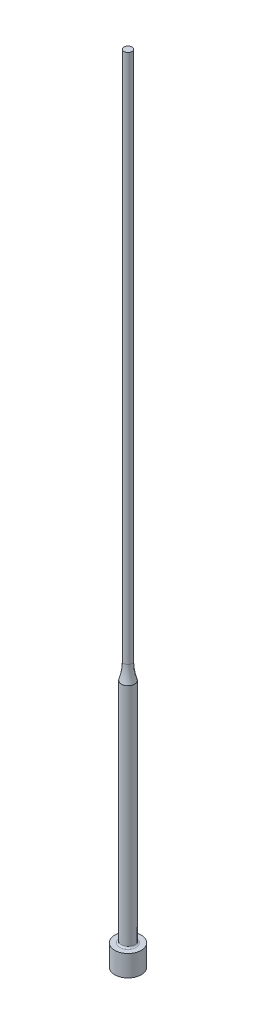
from build123d import *


with BuildPart() as part:
    # Sketch1 → Revolve1 (revolve)
    with BuildSketch(Plane.XY, mode=Mode.PRIVATE) as revolve1_sk:
        with BuildLine():
            Line((0, 0), (2.5, 0))
            Line((2.5, 0), (2.5, 4))
            Line((2.5, 4), (1.55, 4))
            ThreePointArc((1.55, 4), (1.337867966, 4.087867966), (1.25, 4.3))
            Line((1.25, 4.3), (1.25, 46.877501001))
            ThreePointArc((1.25, 46.877501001), (0.875791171, 48.41886117), (0.75, 50))
            Line((0.75, 50), (0.75, 150))
            Line((0.75, 150), (0, 150))
            Line((0, 150), (0, 0))
        make_face()
    revolve(revolve1_sk.sketch.rotate(Axis((0, 150, 0), (0, -1, 0)), 180), axis=Axis((0, 150, 0), (0, -1, 0)))


solid = part.part
